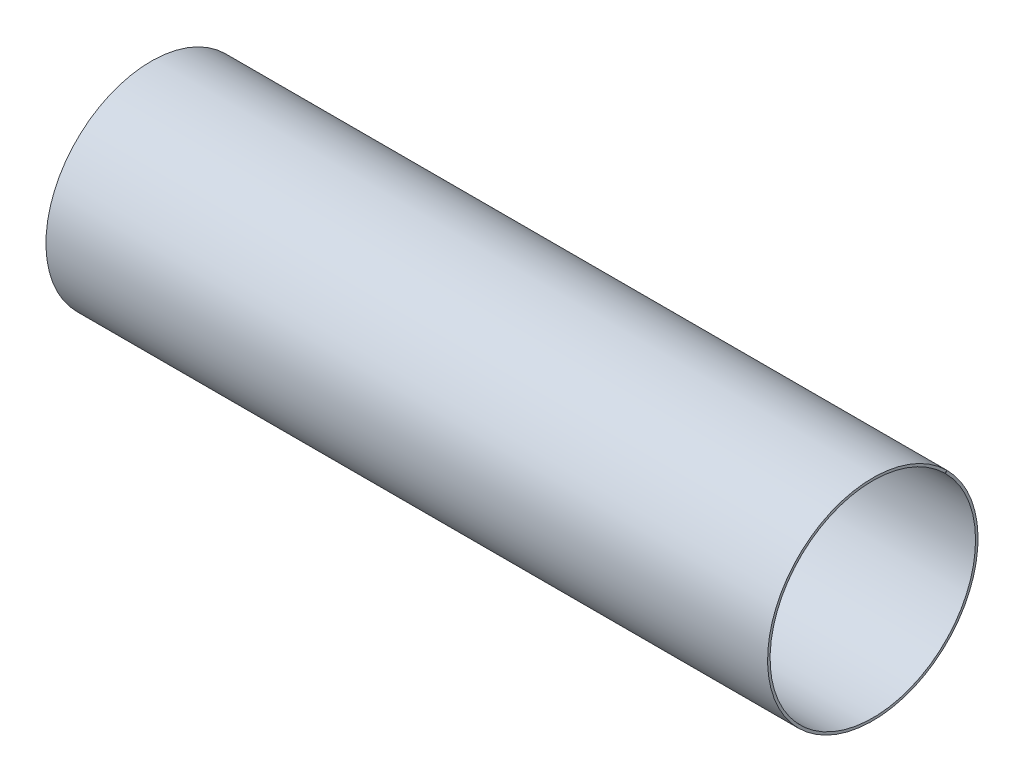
ISO-10303-21;
HEADER;
FILE_DESCRIPTION(('STEP AP214'),'2;1');
FILE_NAME('part.step','',(''),(''),'','','');
FILE_SCHEMA(('AUTOMOTIVE_DESIGN { 1 0 10303 214 1 1 1 1 }'));
ENDSEC;
DATA;
#1=APPLICATION_CONTEXT('core data for automotive mechanical design processes');
#2=APPLICATION_PROTOCOL_DEFINITION('international standard','automotive_design',2000,#1);
#3=PRODUCT_CONTEXT('',#1,'mechanical');
#4=PRODUCT('Part','Part','',(#3));
#5=PRODUCT_RELATED_PRODUCT_CATEGORY('part','',(#4));
#6=PRODUCT_DEFINITION_FORMATION('','',#4);
#7=PRODUCT_DEFINITION_CONTEXT('part definition',#1,'design');
#8=PRODUCT_DEFINITION('design','',#6,#7);
#9=PRODUCT_DEFINITION_SHAPE('','',#8);
#10=(LENGTH_UNIT() NAMED_UNIT(*) SI_UNIT(.MILLI.,.METRE.));
#11=(NAMED_UNIT(*) PLANE_ANGLE_UNIT() SI_UNIT($,.RADIAN.));
#12=(NAMED_UNIT(*) SI_UNIT($,.STERADIAN.) SOLID_ANGLE_UNIT());
#13=UNCERTAINTY_MEASURE_WITH_UNIT(LENGTH_MEASURE(1.E-05),#10,'distance_accuracy_value','');
#14=(GEOMETRIC_REPRESENTATION_CONTEXT(3) GLOBAL_UNCERTAINTY_ASSIGNED_CONTEXT((#13)) GLOBAL_UNIT_ASSIGNED_CONTEXT((#10,
#11,#12)) REPRESENTATION_CONTEXT('',''));
#15=CARTESIAN_POINT('',(0.,0.,0.));
#16=DIRECTION('',(0.,0.,1.));
#17=DIRECTION('',(1.,0.,0.));
#18=AXIS2_PLACEMENT_3D('',#15,#16,#17);
#19=CARTESIAN_POINT('',(-4.44089209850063E-13,374.359374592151,-369.929027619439));
#20=DIRECTION('',(0.,0.702885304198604,0.711303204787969));
#21=DIRECTION('',(1.,0.,0.));
#22=AXIS2_PLACEMENT_3D('',#19,#20,#21);
#23=PLANE('',#22);
#24=DIRECTION('',(0.,0.711303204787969,-0.702885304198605));
#25=VECTOR('',#24,1.);
#26=CARTESIAN_POINT('',(1828.8,374.359374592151,-369.929027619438));
#27=LINE('',#26,#25);
#28=CARTESIAN_POINT('',(1828.8,370.375578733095,-365.992377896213));
#29=VERTEX_POINT('',#28);
#30=CARTESIAN_POINT('',(1828.8,379.409129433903,-374.919021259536));
#31=VERTEX_POINT('',#30);
#32=EDGE_CURVE('E11',#29,#31,#27,.T.);
#33=ORIENTED_EDGE('',*,*,#32,.F.);
#34=DIRECTION('',(-1.,0.,0.));
#35=VECTOR('',#34,1.);
#36=CARTESIAN_POINT('',(6766.06856553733,370.375578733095,-365.992377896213));
#37=LINE('',#36,#35);
#38=CARTESIAN_POINT('',(-1828.8,370.375578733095,-365.992377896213));
#39=VERTEX_POINT('',#38);
#40=EDGE_CURVE('E82',#39,#29,#37,.F.);
#41=ORIENTED_EDGE('',*,*,#40,.F.);
#42=DIRECTION('',(0.,0.711303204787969,-0.702885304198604));
#43=VECTOR('',#42,1.);
#44=CARTESIAN_POINT('',(-1828.8,374.359374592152,-369.929027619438));
#45=LINE('',#44,#43);
#46=CARTESIAN_POINT('',(-1828.8,379.409129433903,-374.919021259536));
#47=VERTEX_POINT('',#46);
#48=EDGE_CURVE('E44',#39,#47,#45,.T.);
#49=ORIENTED_EDGE('',*,*,#48,.T.);
#50=DIRECTION('',(-1.,0.,0.));
#51=VECTOR('',#50,1.);
#52=CARTESIAN_POINT('',(6766.06856553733,379.409129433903,-374.919021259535));
#53=LINE('',#52,#51);
#54=EDGE_CURVE('E81',#47,#31,#53,.F.);
#55=ORIENTED_EDGE('',*,*,#54,.T.);
#56=EDGE_LOOP('',(#33,#41,#49,#55));
#57=FACE_BOUND('',#56,.T.);
#58=ADVANCED_FACE('F34',(#57),#23,.F.);
#59=CARTESIAN_POINT('',(-1828.8,0.,-2.22044604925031E-13));
#60=DIRECTION('',(1.,0.,0.));
#61=DIRECTION('',(0.,1.,0.));
#62=AXIS2_PLACEMENT_3D('',#59,#60,#61);
#63=PLANE('',#62);
#64=ORIENTED_EDGE('',*,*,#48,.F.);
#65=CARTESIAN_POINT('',(-1828.8,0.,-2.22044604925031E-13));
#66=DIRECTION('',(-1.,0.,0.));
#67=DIRECTION('',(0.,0.,1.));
#68=AXIS2_PLACEMENT_3D('',#65,#66,#67);
#69=CIRCLE('',#68,520.7);
#70=CARTESIAN_POINT('',(-1828.8,368.190500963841,-368.19050096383));
#71=VERTEX_POINT('',#70);
#72=EDGE_CURVE('E102',#71,#39,#69,.T.);
#73=ORIENTED_EDGE('',*,*,#72,.F.);
#74=DIRECTION('',(0.,0.707106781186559,-0.707106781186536));
#75=VECTOR('',#74,1.);
#76=CARTESIAN_POINT('',(-1828.8,372.150793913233,-372.150793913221));
#77=LINE('',#76,#75);
#78=CARTESIAN_POINT('',(-1828.8,377.17075708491,-377.170757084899));
#79=VERTEX_POINT('',#78);
#80=EDGE_CURVE('E77',#71,#79,#77,.T.);
#81=ORIENTED_EDGE('',*,*,#80,.T.);
#82=CARTESIAN_POINT('',(-1828.8,0.,-2.22044604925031E-13));
#83=DIRECTION('',(-1.,0.,0.));
#84=DIRECTION('',(0.,0.,1.));
#85=AXIS2_PLACEMENT_3D('',#82,#83,#84);
#86=CIRCLE('',#85,533.4);
#87=EDGE_CURVE('E89',#79,#47,#86,.T.);
#88=ORIENTED_EDGE('',*,*,#87,.T.);
#89=EDGE_LOOP('',(#64,#73,#81,#88));
#90=FACE_BOUND('',#89,.T.);
#91=ADVANCED_FACE('F92',(#90),#63,.F.);
#92=CARTESIAN_POINT('',(1.11022302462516E-12,372.150793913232,-372.150793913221));
#93=DIRECTION('',(0.,-0.707106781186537,-0.707106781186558));
#94=DIRECTION('',(-1.,0.,0.));
#95=AXIS2_PLACEMENT_3D('',#92,#93,#94);
#96=PLANE('',#95);
#97=ORIENTED_EDGE('',*,*,#80,.F.);
#98=DIRECTION('',(-1.,0.,0.));
#99=VECTOR('',#98,1.);
#100=CARTESIAN_POINT('',(6766.06856553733,368.190500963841,-368.190500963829));
#101=LINE('',#100,#99);
#102=CARTESIAN_POINT('',(1828.8,368.190500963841,-368.19050096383));
#103=VERTEX_POINT('',#102);
#104=EDGE_CURVE('E93',#103,#71,#101,.T.);
#105=ORIENTED_EDGE('',*,*,#104,.F.);
#106=DIRECTION('',(0.,0.707106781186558,-0.707106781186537));
#107=VECTOR('',#106,1.);
#108=CARTESIAN_POINT('',(1828.8,372.150793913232,-372.150793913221));
#109=LINE('',#108,#107);
#110=CARTESIAN_POINT('',(1828.8,377.17075708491,-377.170757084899));
#111=VERTEX_POINT('',#110);
#112=EDGE_CURVE('E38',#103,#111,#109,.T.);
#113=ORIENTED_EDGE('',*,*,#112,.T.);
#114=DIRECTION('',(-1.,0.,0.));
#115=VECTOR('',#114,1.);
#116=CARTESIAN_POINT('',(6766.06856553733,377.17075708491,-377.170757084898));
#117=LINE('',#116,#115);
#118=EDGE_CURVE('E99',#111,#79,#117,.T.);
#119=ORIENTED_EDGE('',*,*,#118,.T.);
#120=EDGE_LOOP('',(#97,#105,#113,#119));
#121=FACE_BOUND('',#120,.T.);
#122=ADVANCED_FACE('F106',(#121),#96,.F.);
#123=CARTESIAN_POINT('',(1828.8,0.,0.));
#124=DIRECTION('',(-1.,0.,0.));
#125=DIRECTION('',(0.,-1.,0.));
#126=AXIS2_PLACEMENT_3D('',#123,#124,#125);
#127=PLANE('',#126);
#128=CARTESIAN_POINT('',(1828.8,0.,0.));
#129=DIRECTION('',(-1.,0.,0.));
#130=DIRECTION('',(0.,0.,1.));
#131=AXIS2_PLACEMENT_3D('',#128,#129,#130);
#132=CIRCLE('',#131,520.7);
#133=EDGE_CURVE('E96',#29,#103,#132,.F.);
#134=ORIENTED_EDGE('',*,*,#133,.F.);
#135=ORIENTED_EDGE('',*,*,#32,.T.);
#136=CARTESIAN_POINT('',(1828.8,0.,0.));
#137=DIRECTION('',(-1.,0.,0.));
#138=DIRECTION('',(0.,0.,1.));
#139=AXIS2_PLACEMENT_3D('',#136,#137,#138);
#140=CIRCLE('',#139,533.4);
#141=EDGE_CURVE('E90',#31,#111,#140,.F.);
#142=ORIENTED_EDGE('',*,*,#141,.T.);
#143=ORIENTED_EDGE('',*,*,#112,.F.);
#144=EDGE_LOOP('',(#134,#135,#142,#143));
#145=FACE_BOUND('',#144,.T.);
#146=ADVANCED_FACE('F36',(#145),#127,.F.);
#147=CARTESIAN_POINT('',(6766.06856553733,0.,2.99730382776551E-13));
#148=DIRECTION('',(-1.,0.,0.));
#149=DIRECTION('',(0.,0.,1.));
#150=AXIS2_PLACEMENT_3D('',#147,#148,#149);
#151=CYLINDRICAL_SURFACE('',#150,533.4);
#152=ORIENTED_EDGE('',*,*,#118,.F.);
#153=ORIENTED_EDGE('',*,*,#141,.F.);
#154=ORIENTED_EDGE('',*,*,#54,.F.);
#155=ORIENTED_EDGE('',*,*,#87,.F.);
#156=EDGE_LOOP('',(#152,#153,#154,#155));
#157=FACE_BOUND('',#156,.T.);
#158=ADVANCED_FACE('F88',(#157),#151,.T.);
#159=CARTESIAN_POINT('',(6766.06856553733,0.,2.99730382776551E-13));
#160=DIRECTION('',(-1.,0.,0.));
#161=DIRECTION('',(0.,0.,1.));
#162=AXIS2_PLACEMENT_3D('',#159,#160,#161);
#163=CYLINDRICAL_SURFACE('',#162,520.7);
#164=ORIENTED_EDGE('',*,*,#104,.T.);
#165=ORIENTED_EDGE('',*,*,#72,.T.);
#166=ORIENTED_EDGE('',*,*,#40,.T.);
#167=ORIENTED_EDGE('',*,*,#133,.T.);
#168=EDGE_LOOP('',(#164,#165,#166,#167));
#169=FACE_BOUND('',#168,.T.);
#170=ADVANCED_FACE('F108',(#169),#163,.F.);
#171=CLOSED_SHELL('',(#58,#91,#122,#146,#158,#170));
#172=MANIFOLD_SOLID_BREP('B2',#171);
#173=ADVANCED_BREP_SHAPE_REPRESENTATION('',(#18,#172),#14);
#174=SHAPE_DEFINITION_REPRESENTATION(#9,#173);
ENDSEC;
END-ISO-10303-21;
